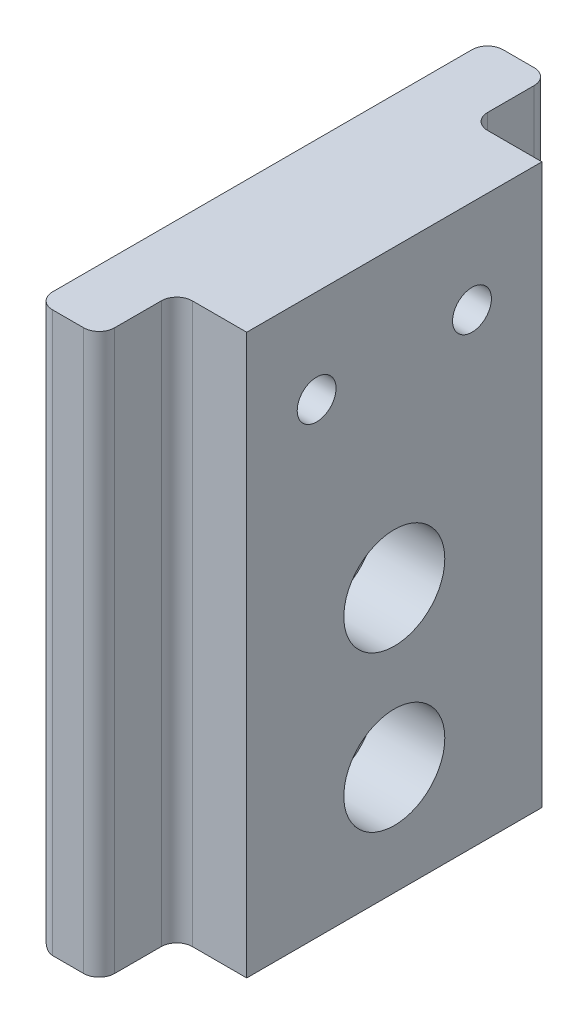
ISO-10303-21;
HEADER;
FILE_DESCRIPTION(('STEP AP214'),'2;1');
FILE_NAME('part.step','',(''),(''),'','','');
FILE_SCHEMA(('AUTOMOTIVE_DESIGN { 1 0 10303 214 1 1 1 1 }'));
ENDSEC;
DATA;
#1=APPLICATION_CONTEXT('core data for automotive mechanical design processes');
#2=APPLICATION_PROTOCOL_DEFINITION('international standard','automotive_design',2000,#1);
#3=PRODUCT_CONTEXT('',#1,'mechanical');
#4=PRODUCT('Part','Part','',(#3));
#5=PRODUCT_RELATED_PRODUCT_CATEGORY('part','',(#4));
#6=PRODUCT_DEFINITION_FORMATION('','',#4);
#7=PRODUCT_DEFINITION_CONTEXT('part definition',#1,'design');
#8=PRODUCT_DEFINITION('design','',#6,#7);
#9=PRODUCT_DEFINITION_SHAPE('','',#8);
#10=(LENGTH_UNIT() NAMED_UNIT(*) SI_UNIT(.MILLI.,.METRE.));
#11=(NAMED_UNIT(*) PLANE_ANGLE_UNIT() SI_UNIT($,.RADIAN.));
#12=(NAMED_UNIT(*) SI_UNIT($,.STERADIAN.) SOLID_ANGLE_UNIT());
#13=UNCERTAINTY_MEASURE_WITH_UNIT(LENGTH_MEASURE(1.E-05),#10,'distance_accuracy_value','');
#14=(GEOMETRIC_REPRESENTATION_CONTEXT(3) GLOBAL_UNCERTAINTY_ASSIGNED_CONTEXT((#13)) GLOBAL_UNIT_ASSIGNED_CONTEXT((#10,
#11,#12)) REPRESENTATION_CONTEXT('',''));
#15=CARTESIAN_POINT('',(0.,0.,0.));
#16=DIRECTION('',(0.,0.,1.));
#17=DIRECTION('',(1.,0.,0.));
#18=AXIS2_PLACEMENT_3D('',#15,#16,#17);
#19=CARTESIAN_POINT('',(0.,0.,0.));
#20=DIRECTION('',(1.,0.,0.));
#21=DIRECTION('',(0.,0.,-1.));
#22=AXIS2_PLACEMENT_3D('',#19,#20,#21);
#23=PLANE('',#22);
#24=DIRECTION('',(0.,0.,1.));
#25=VECTOR('',#24,1.);
#26=CARTESIAN_POINT('',(0.,6.,10.));
#27=LINE('',#26,#25);
#28=CARTESIAN_POINT('',(0.,6.,-9.5));
#29=VERTEX_POINT('',#28);
#30=CARTESIAN_POINT('',(0.,6.,9.5));
#31=VERTEX_POINT('',#30);
#32=EDGE_CURVE('E152',#29,#31,#27,.T.);
#33=ORIENTED_EDGE('',*,*,#32,.T.);
#34=DIRECTION('',(0.,1.,0.));
#35=VECTOR('',#34,1.);
#36=CARTESIAN_POINT('',(0.,-30.,9.5));
#37=LINE('',#36,#35);
#38=CARTESIAN_POINT('',(0.,-30.,9.5));
#39=VERTEX_POINT('',#38);
#40=EDGE_CURVE('E137',#39,#31,#37,.T.);
#41=ORIENTED_EDGE('',*,*,#40,.F.);
#42=DIRECTION('',(0.,0.,-1.));
#43=VECTOR('',#42,1.);
#44=CARTESIAN_POINT('',(0.,-30.,-10.));
#45=LINE('',#44,#43);
#46=CARTESIAN_POINT('',(0.,-30.,-9.5));
#47=VERTEX_POINT('',#46);
#48=EDGE_CURVE('E249',#39,#47,#45,.T.);
#49=ORIENTED_EDGE('',*,*,#48,.T.);
#50=DIRECTION('',(0.,1.,0.));
#51=VECTOR('',#50,1.);
#52=CARTESIAN_POINT('',(0.,-30.,-9.5));
#53=LINE('',#52,#51);
#54=EDGE_CURVE('E147',#47,#29,#53,.T.);
#55=ORIENTED_EDGE('',*,*,#54,.T.);
#56=EDGE_LOOP('',(#33,#41,#49,#55));
#57=FACE_BOUND('',#56,.T.);
#58=CARTESIAN_POINT('',(0.,0.,-5.));
#59=DIRECTION('',(1.,0.,0.));
#60=DIRECTION('',(0.,0.,-1.));
#61=AXIS2_PLACEMENT_3D('',#58,#59,#60);
#62=CIRCLE('',#61,1.25);
#63=CARTESIAN_POINT('',(0.,0.,-6.25));
#64=VERTEX_POINT('',#63);
#65=EDGE_CURVE('E164',#64,#64,#62,.F.);
#66=ORIENTED_EDGE('',*,*,#65,.T.);
#67=EDGE_LOOP('',(#66));
#68=FACE_BOUND('',#67,.T.);
#69=CARTESIAN_POINT('',(0.,0.,5.));
#70=DIRECTION('',(1.,0.,0.));
#71=DIRECTION('',(0.,0.,-1.));
#72=AXIS2_PLACEMENT_3D('',#69,#70,#71);
#73=CIRCLE('',#72,1.25);
#74=CARTESIAN_POINT('',(0.,0.,3.75));
#75=VERTEX_POINT('',#74);
#76=EDGE_CURVE('E160',#75,#75,#73,.F.);
#77=ORIENTED_EDGE('',*,*,#76,.T.);
#78=EDGE_LOOP('',(#77));
#79=FACE_BOUND('',#78,.T.);
#80=CARTESIAN_POINT('',(0.,-13.,0.));
#81=DIRECTION('',(1.,0.,0.));
#82=DIRECTION('',(0.,0.,-1.));
#83=AXIS2_PLACEMENT_3D('',#80,#81,#82);
#84=CIRCLE('',#83,3.25);
#85=CARTESIAN_POINT('',(0.,-13.,-3.25));
#86=VERTEX_POINT('',#85);
#87=EDGE_CURVE('E288',#86,#86,#84,.T.);
#88=ORIENTED_EDGE('',*,*,#87,.F.);
#89=EDGE_LOOP('',(#88));
#90=FACE_BOUND('',#89,.T.);
#91=CARTESIAN_POINT('',(0.,-23.,0.));
#92=DIRECTION('',(1.,0.,0.));
#93=DIRECTION('',(0.,0.,-1.));
#94=AXIS2_PLACEMENT_3D('',#91,#92,#93);
#95=CIRCLE('',#94,3.25);
#96=CARTESIAN_POINT('',(0.,-23.,-3.25));
#97=VERTEX_POINT('',#96);
#98=EDGE_CURVE('E296',#97,#97,#95,.T.);
#99=ORIENTED_EDGE('',*,*,#98,.F.);
#100=EDGE_LOOP('',(#99));
#101=FACE_BOUND('',#100,.T.);
#102=ADVANCED_FACE('F41',(#57,#68,#79,#90,#101),#23,.T.);
#103=CARTESIAN_POINT('',(-4.5,1.7,5.));
#104=DIRECTION('',(1.,0.,0.));
#105=DIRECTION('',(0.,0.,-1.));
#106=AXIS2_PLACEMENT_3D('',#103,#104,#105);
#107=PLANE('',#106);
#108=CARTESIAN_POINT('',(-4.5,0.,5.));
#109=DIRECTION('',(-1.,0.,0.));
#110=DIRECTION('',(0.,0.,1.));
#111=AXIS2_PLACEMENT_3D('',#108,#109,#110);
#112=CIRCLE('',#111,1.7);
#113=CARTESIAN_POINT('',(-4.5,0.,6.69999999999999));
#114=VERTEX_POINT('',#113);
#115=EDGE_CURVE('E310',#114,#114,#112,.T.);
#116=ORIENTED_EDGE('',*,*,#115,.F.);
#117=EDGE_LOOP('',(#116));
#118=FACE_BOUND('',#117,.T.);
#119=CARTESIAN_POINT('',(-4.5,0.,5.));
#120=DIRECTION('',(-1.,0.,0.));
#121=DIRECTION('',(0.,0.,1.));
#122=AXIS2_PLACEMENT_3D('',#119,#120,#121);
#123=CIRCLE('',#122,3.25);
#124=CARTESIAN_POINT('',(-4.5,0.,8.25));
#125=VERTEX_POINT('',#124);
#126=EDGE_CURVE('E313',#125,#125,#123,.T.);
#127=ORIENTED_EDGE('',*,*,#126,.T.);
#128=EDGE_LOOP('',(#127));
#129=FACE_BOUND('',#128,.T.);
#130=ADVANCED_FACE('F193',(#118,#129),#107,.F.);
#131=CARTESIAN_POINT('',(-9.,0.,5.));
#132=DIRECTION('',(-1.,0.,0.));
#133=DIRECTION('',(0.,0.,1.));
#134=AXIS2_PLACEMENT_3D('',#131,#132,#133);
#135=CYLINDRICAL_SURFACE('',#134,1.7);
#136=CARTESIAN_POINT('',(-4.,0.,5.));
#137=DIRECTION('',(-1.,0.,0.));
#138=DIRECTION('',(0.,0.,1.));
#139=AXIS2_PLACEMENT_3D('',#136,#137,#138);
#140=CIRCLE('',#139,1.7);
#141=CARTESIAN_POINT('',(-4.,0.,6.69999999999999));
#142=VERTEX_POINT('',#141);
#143=EDGE_CURVE('E287',#142,#142,#140,.T.);
#144=ORIENTED_EDGE('',*,*,#143,.F.);
#145=EDGE_LOOP('',(#144));
#146=FACE_BOUND('',#145,.T.);
#147=ORIENTED_EDGE('',*,*,#115,.T.);
#148=EDGE_LOOP('',(#147));
#149=FACE_BOUND('',#148,.T.);
#150=ADVANCED_FACE('F195',(#146,#149),#135,.F.);
#151=CARTESIAN_POINT('',(-4.,0.,5.));
#152=DIRECTION('',(-1.,0.,0.));
#153=DIRECTION('',(0.,0.,1.));
#154=AXIS2_PLACEMENT_3D('',#151,#152,#153);
#155=CONICAL_SURFACE('',#154,1.7,1.02974425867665);
#156=ORIENTED_EDGE('',*,*,#143,.T.);
#157=EDGE_LOOP('',(#156));
#158=FACE_BOUND('',#157,.T.);
#159=CARTESIAN_POINT('',(-3.7296127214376,0.,5.));
#160=DIRECTION('',(-1.,0.,0.));
#161=DIRECTION('',(0.,0.,1.));
#162=AXIS2_PLACEMENT_3D('',#159,#160,#161);
#163=CIRCLE('',#162,1.25);
#164=CARTESIAN_POINT('',(-3.7296127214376,0.,6.25));
#165=VERTEX_POINT('',#164);
#166=EDGE_CURVE('E284',#165,#165,#163,.T.);
#167=ORIENTED_EDGE('',*,*,#166,.F.);
#168=EDGE_LOOP('',(#167));
#169=FACE_BOUND('',#168,.T.);
#170=ADVANCED_FACE('F202',(#158,#169),#155,.F.);
#171=CARTESIAN_POINT('',(-9.,0.,5.));
#172=DIRECTION('',(-1.,0.,0.));
#173=DIRECTION('',(0.,0.,1.));
#174=AXIS2_PLACEMENT_3D('',#171,#172,#173);
#175=CYLINDRICAL_SURFACE('',#174,1.25);
#176=ORIENTED_EDGE('',*,*,#166,.T.);
#177=EDGE_LOOP('',(#176));
#178=FACE_BOUND('',#177,.T.);
#179=ORIENTED_EDGE('',*,*,#76,.F.);
#180=EDGE_LOOP('',(#179));
#181=FACE_BOUND('',#180,.T.);
#182=ADVANCED_FACE('F222',(#178,#181),#175,.F.);
#183=CARTESIAN_POINT('',(-4.5,1.7,-5.));
#184=DIRECTION('',(1.,0.,0.));
#185=DIRECTION('',(0.,0.,-1.));
#186=AXIS2_PLACEMENT_3D('',#183,#184,#185);
#187=PLANE('',#186);
#188=CARTESIAN_POINT('',(-4.5,0.,-5.));
#189=DIRECTION('',(-1.,0.,0.));
#190=DIRECTION('',(0.,0.,1.));
#191=AXIS2_PLACEMENT_3D('',#188,#189,#190);
#192=CIRCLE('',#191,1.7);
#193=CARTESIAN_POINT('',(-4.5,0.,-3.3));
#194=VERTEX_POINT('',#193);
#195=EDGE_CURVE('E243',#194,#194,#192,.T.);
#196=ORIENTED_EDGE('',*,*,#195,.F.);
#197=EDGE_LOOP('',(#196));
#198=FACE_BOUND('',#197,.T.);
#199=CARTESIAN_POINT('',(-4.5,0.,-5.));
#200=DIRECTION('',(-1.,0.,0.));
#201=DIRECTION('',(0.,0.,1.));
#202=AXIS2_PLACEMENT_3D('',#199,#200,#201);
#203=CIRCLE('',#202,3.25);
#204=CARTESIAN_POINT('',(-4.5,0.,-1.75));
#205=VERTEX_POINT('',#204);
#206=EDGE_CURVE('E167',#205,#205,#203,.T.);
#207=ORIENTED_EDGE('',*,*,#206,.T.);
#208=EDGE_LOOP('',(#207));
#209=FACE_BOUND('',#208,.T.);
#210=ADVANCED_FACE('F218',(#198,#209),#187,.F.);
#211=CARTESIAN_POINT('',(-9.,0.,-5.));
#212=DIRECTION('',(-1.,0.,0.));
#213=DIRECTION('',(0.,0.,1.));
#214=AXIS2_PLACEMENT_3D('',#211,#212,#213);
#215=CYLINDRICAL_SURFACE('',#214,1.7);
#216=CARTESIAN_POINT('',(-4.,0.,-5.));
#217=DIRECTION('',(-1.,0.,0.));
#218=DIRECTION('',(0.,0.,1.));
#219=AXIS2_PLACEMENT_3D('',#216,#217,#218);
#220=CIRCLE('',#219,1.7);
#221=CARTESIAN_POINT('',(-4.,0.,-3.3));
#222=VERTEX_POINT('',#221);
#223=EDGE_CURVE('E283',#222,#222,#220,.T.);
#224=ORIENTED_EDGE('',*,*,#223,.F.);
#225=EDGE_LOOP('',(#224));
#226=FACE_BOUND('',#225,.T.);
#227=ORIENTED_EDGE('',*,*,#195,.T.);
#228=EDGE_LOOP('',(#227));
#229=FACE_BOUND('',#228,.T.);
#230=ADVANCED_FACE('F187',(#226,#229),#215,.F.);
#231=CARTESIAN_POINT('',(-4.,0.,-5.));
#232=DIRECTION('',(-1.,0.,0.));
#233=DIRECTION('',(0.,0.,1.));
#234=AXIS2_PLACEMENT_3D('',#231,#232,#233);
#235=CONICAL_SURFACE('',#234,1.7,1.02974425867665);
#236=ORIENTED_EDGE('',*,*,#223,.T.);
#237=EDGE_LOOP('',(#236));
#238=FACE_BOUND('',#237,.T.);
#239=CARTESIAN_POINT('',(-3.7296127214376,0.,-5.));
#240=DIRECTION('',(-1.,0.,0.));
#241=DIRECTION('',(0.,0.,1.));
#242=AXIS2_PLACEMENT_3D('',#239,#240,#241);
#243=CIRCLE('',#242,1.25);
#244=CARTESIAN_POINT('',(-3.7296127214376,0.,-3.75));
#245=VERTEX_POINT('',#244);
#246=EDGE_CURVE('E281',#245,#245,#243,.T.);
#247=ORIENTED_EDGE('',*,*,#246,.F.);
#248=EDGE_LOOP('',(#247));
#249=FACE_BOUND('',#248,.T.);
#250=ADVANCED_FACE('F177',(#238,#249),#235,.F.);
#251=CARTESIAN_POINT('',(-9.,0.,-5.));
#252=DIRECTION('',(-1.,0.,0.));
#253=DIRECTION('',(0.,0.,1.));
#254=AXIS2_PLACEMENT_3D('',#251,#252,#253);
#255=CYLINDRICAL_SURFACE('',#254,1.25);
#256=ORIENTED_EDGE('',*,*,#246,.T.);
#257=EDGE_LOOP('',(#256));
#258=FACE_BOUND('',#257,.T.);
#259=ORIENTED_EDGE('',*,*,#65,.F.);
#260=EDGE_LOOP('',(#259));
#261=FACE_BOUND('',#260,.T.);
#262=ADVANCED_FACE('F174',(#258,#261),#255,.F.);
#263=CARTESIAN_POINT('',(0.,-23.,0.));
#264=DIRECTION('',(1.,0.,0.));
#265=DIRECTION('',(0.,0.,-1.));
#266=AXIS2_PLACEMENT_3D('',#263,#264,#265);
#267=CYLINDRICAL_SURFACE('',#266,1.7);
#268=CARTESIAN_POINT('',(-8.5,-23.,0.));
#269=DIRECTION('',(-1.,0.,0.));
#270=DIRECTION('',(0.,0.,1.));
#271=AXIS2_PLACEMENT_3D('',#268,#269,#270);
#272=CIRCLE('',#271,1.7);
#273=CARTESIAN_POINT('',(-8.5,-23.,1.7));
#274=VERTEX_POINT('',#273);
#275=EDGE_CURVE('E280',#274,#274,#272,.F.);
#276=ORIENTED_EDGE('',*,*,#275,.F.);
#277=EDGE_LOOP('',(#276));
#278=FACE_BOUND('',#277,.T.);
#279=CARTESIAN_POINT('',(-4.5,-23.,0.));
#280=DIRECTION('',(1.,0.,0.));
#281=DIRECTION('',(0.,0.,-1.));
#282=AXIS2_PLACEMENT_3D('',#279,#280,#281);
#283=CIRCLE('',#282,1.7);
#284=CARTESIAN_POINT('',(-4.5,-23.,-1.7));
#285=VERTEX_POINT('',#284);
#286=EDGE_CURVE('E290',#285,#285,#283,.T.);
#287=ORIENTED_EDGE('',*,*,#286,.T.);
#288=EDGE_LOOP('',(#287));
#289=FACE_BOUND('',#288,.T.);
#290=ADVANCED_FACE('F176',(#278,#289),#267,.F.);
#291=CARTESIAN_POINT('',(-4.5,-21.3,0.));
#292=DIRECTION('',(-1.,0.,0.));
#293=DIRECTION('',(0.,0.,1.));
#294=AXIS2_PLACEMENT_3D('',#291,#292,#293);
#295=PLANE('',#294);
#296=ORIENTED_EDGE('',*,*,#286,.F.);
#297=EDGE_LOOP('',(#296));
#298=FACE_BOUND('',#297,.T.);
#299=CARTESIAN_POINT('',(-4.5,-23.,0.));
#300=DIRECTION('',(1.,0.,0.));
#301=DIRECTION('',(0.,0.,-1.));
#302=AXIS2_PLACEMENT_3D('',#299,#300,#301);
#303=CIRCLE('',#302,3.25);
#304=CARTESIAN_POINT('',(-4.5,-23.,-3.25));
#305=VERTEX_POINT('',#304);
#306=EDGE_CURVE('E293',#305,#305,#303,.T.);
#307=ORIENTED_EDGE('',*,*,#306,.T.);
#308=EDGE_LOOP('',(#307));
#309=FACE_BOUND('',#308,.T.);
#310=ADVANCED_FACE('F184',(#298,#309),#295,.F.);
#311=CARTESIAN_POINT('',(0.,-23.,0.));
#312=DIRECTION('',(1.,0.,0.));
#313=DIRECTION('',(0.,0.,-1.));
#314=AXIS2_PLACEMENT_3D('',#311,#312,#313);
#315=CYLINDRICAL_SURFACE('',#314,3.25);
#316=ORIENTED_EDGE('',*,*,#306,.F.);
#317=EDGE_LOOP('',(#316));
#318=FACE_BOUND('',#317,.T.);
#319=ORIENTED_EDGE('',*,*,#98,.T.);
#320=EDGE_LOOP('',(#319));
#321=FACE_BOUND('',#320,.T.);
#322=ADVANCED_FACE('F454',(#318,#321),#315,.F.);
#323=CARTESIAN_POINT('',(0.,-13.,0.));
#324=DIRECTION('',(1.,0.,0.));
#325=DIRECTION('',(0.,0.,-1.));
#326=AXIS2_PLACEMENT_3D('',#323,#324,#325);
#327=CYLINDRICAL_SURFACE('',#326,1.7);
#328=CARTESIAN_POINT('',(-8.5,-13.,0.));
#329=DIRECTION('',(-1.,0.,0.));
#330=DIRECTION('',(0.,0.,1.));
#331=AXIS2_PLACEMENT_3D('',#328,#329,#330);
#332=CIRCLE('',#331,1.7);
#333=CARTESIAN_POINT('',(-8.5,-13.,1.7));
#334=VERTEX_POINT('',#333);
#335=EDGE_CURVE('E299',#334,#334,#332,.F.);
#336=ORIENTED_EDGE('',*,*,#335,.F.);
#337=EDGE_LOOP('',(#336));
#338=FACE_BOUND('',#337,.T.);
#339=CARTESIAN_POINT('',(-4.5,-13.,0.));
#340=DIRECTION('',(1.,0.,0.));
#341=DIRECTION('',(0.,0.,-1.));
#342=AXIS2_PLACEMENT_3D('',#339,#340,#341);
#343=CIRCLE('',#342,1.7);
#344=CARTESIAN_POINT('',(-4.5,-13.,-1.7));
#345=VERTEX_POINT('',#344);
#346=EDGE_CURVE('E300',#345,#345,#343,.T.);
#347=ORIENTED_EDGE('',*,*,#346,.T.);
#348=EDGE_LOOP('',(#347));
#349=FACE_BOUND('',#348,.T.);
#350=ADVANCED_FACE('F458',(#338,#349),#327,.F.);
#351=CARTESIAN_POINT('',(-4.5,-11.3,0.));
#352=DIRECTION('',(-1.,0.,0.));
#353=DIRECTION('',(0.,0.,1.));
#354=AXIS2_PLACEMENT_3D('',#351,#352,#353);
#355=PLANE('',#354);
#356=ORIENTED_EDGE('',*,*,#346,.F.);
#357=EDGE_LOOP('',(#356));
#358=FACE_BOUND('',#357,.T.);
#359=CARTESIAN_POINT('',(-4.5,-13.,0.));
#360=DIRECTION('',(1.,0.,0.));
#361=DIRECTION('',(0.,0.,-1.));
#362=AXIS2_PLACEMENT_3D('',#359,#360,#361);
#363=CIRCLE('',#362,3.25);
#364=CARTESIAN_POINT('',(-4.5,-13.,-3.25));
#365=VERTEX_POINT('',#364);
#366=EDGE_CURVE('E303',#365,#365,#363,.T.);
#367=ORIENTED_EDGE('',*,*,#366,.T.);
#368=EDGE_LOOP('',(#367));
#369=FACE_BOUND('',#368,.T.);
#370=ADVANCED_FACE('F462',(#358,#369),#355,.F.);
#371=CARTESIAN_POINT('',(0.,-13.,0.));
#372=DIRECTION('',(1.,0.,0.));
#373=DIRECTION('',(0.,0.,-1.));
#374=AXIS2_PLACEMENT_3D('',#371,#372,#373);
#375=CYLINDRICAL_SURFACE('',#374,3.25);
#376=ORIENTED_EDGE('',*,*,#366,.F.);
#377=EDGE_LOOP('',(#376));
#378=FACE_BOUND('',#377,.T.);
#379=ORIENTED_EDGE('',*,*,#87,.T.);
#380=EDGE_LOOP('',(#379));
#381=FACE_BOUND('',#380,.T.);
#382=ADVANCED_FACE('F213',(#378,#381),#375,.F.);
#383=CARTESIAN_POINT('',(-9.,0.,5.));
#384=DIRECTION('',(-1.,0.,0.));
#385=DIRECTION('',(0.,0.,1.));
#386=AXIS2_PLACEMENT_3D('',#383,#384,#385);
#387=CYLINDRICAL_SURFACE('',#386,3.25);
#388=ORIENTED_EDGE('',*,*,#126,.F.);
#389=EDGE_LOOP('',(#388));
#390=FACE_BOUND('',#389,.T.);
#391=CARTESIAN_POINT('',(-8.5,0.,5.));
#392=DIRECTION('',(-1.,0.,0.));
#393=DIRECTION('',(0.,0.,1.));
#394=AXIS2_PLACEMENT_3D('',#391,#392,#393);
#395=CIRCLE('',#394,3.25);
#396=CARTESIAN_POINT('',(-8.5,0.,8.25));
#397=VERTEX_POINT('',#396);
#398=EDGE_CURVE('E246',#397,#397,#395,.T.);
#399=ORIENTED_EDGE('',*,*,#398,.T.);
#400=EDGE_LOOP('',(#399));
#401=FACE_BOUND('',#400,.T.);
#402=ADVANCED_FACE('F210',(#390,#401),#387,.F.);
#403=CARTESIAN_POINT('',(-9.,0.,-5.));
#404=DIRECTION('',(-1.,0.,0.));
#405=DIRECTION('',(0.,0.,1.));
#406=AXIS2_PLACEMENT_3D('',#403,#404,#405);
#407=CYLINDRICAL_SURFACE('',#406,3.25);
#408=ORIENTED_EDGE('',*,*,#206,.F.);
#409=EDGE_LOOP('',(#408));
#410=FACE_BOUND('',#409,.T.);
#411=CARTESIAN_POINT('',(-8.5,0.,-5.));
#412=DIRECTION('',(-1.,0.,0.));
#413=DIRECTION('',(0.,0.,1.));
#414=AXIS2_PLACEMENT_3D('',#411,#412,#413);
#415=CIRCLE('',#414,3.25);
#416=CARTESIAN_POINT('',(-8.5,0.,-1.75));
#417=VERTEX_POINT('',#416);
#418=EDGE_CURVE('E238',#417,#417,#415,.T.);
#419=ORIENTED_EDGE('',*,*,#418,.T.);
#420=EDGE_LOOP('',(#419));
#421=FACE_BOUND('',#420,.T.);
#422=ADVANCED_FACE('F212',(#410,#421),#407,.F.);
#423=CARTESIAN_POINT('',(-7.5,-30.,13.5));
#424=DIRECTION('',(0.,1.,0.));
#425=DIRECTION('',(0.,0.,1.));
#426=AXIS2_PLACEMENT_3D('',#423,#424,#425);
#427=CYLINDRICAL_SURFACE('',#426,1.);
#428=CARTESIAN_POINT('',(-7.5,-29.,13.5));
#429=DIRECTION('',(0.,-0.707106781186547,-0.707106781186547));
#430=DIRECTION('',(0.,0.707106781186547,-0.707106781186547));
#431=AXIS2_PLACEMENT_3D('',#428,#429,#430);
#432=ELLIPSE('',#431,1.41421356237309,1.);
#433=CARTESIAN_POINT('',(-8.5,-29.,13.5));
#434=VERTEX_POINT('',#433);
#435=CARTESIAN_POINT('',(-7.5,-30.,14.5));
#436=VERTEX_POINT('',#435);
#437=EDGE_CURVE('E11',#434,#436,#432,.F.);
#438=ORIENTED_EDGE('',*,*,#437,.T.);
#439=DIRECTION('',(0.,1.,0.));
#440=VECTOR('',#439,1.);
#441=CARTESIAN_POINT('',(-7.5,-30.,14.5));
#442=LINE('',#441,#440);
#443=CARTESIAN_POINT('',(-7.5,6.,14.5));
#444=VERTEX_POINT('',#443);
#445=EDGE_CURVE('E359',#444,#436,#442,.F.);
#446=ORIENTED_EDGE('',*,*,#445,.F.);
#447=CARTESIAN_POINT('',(-7.5,6.,13.5));
#448=DIRECTION('',(0.,-1.,0.));
#449=DIRECTION('',(0.,0.,-1.));
#450=AXIS2_PLACEMENT_3D('',#447,#448,#449);
#451=CIRCLE('',#450,1.);
#452=CARTESIAN_POINT('',(-8.5,6.,13.5));
#453=VERTEX_POINT('',#452);
#454=EDGE_CURVE('E355',#453,#444,#451,.F.);
#455=ORIENTED_EDGE('',*,*,#454,.F.);
#456=DIRECTION('',(0.,1.,0.));
#457=VECTOR('',#456,1.);
#458=CARTESIAN_POINT('',(-8.5,-30.,13.5));
#459=LINE('',#458,#457);
#460=EDGE_CURVE('E344',#434,#453,#459,.T.);
#461=ORIENTED_EDGE('',*,*,#460,.F.);
#462=EDGE_LOOP('',(#438,#446,#455,#461));
#463=FACE_BOUND('',#462,.T.);
#464=ADVANCED_FACE('F225',(#463),#427,.T.);
#465=CARTESIAN_POINT('',(-8.5,-30.,-15.));
#466=DIRECTION('',(-1.,0.,0.));
#467=DIRECTION('',(0.,0.,1.));
#468=AXIS2_PLACEMENT_3D('',#465,#466,#467);
#469=PLANE('',#468);
#470=ORIENTED_EDGE('',*,*,#418,.F.);
#471=EDGE_LOOP('',(#470));
#472=FACE_BOUND('',#471,.T.);
#473=ORIENTED_EDGE('',*,*,#398,.F.);
#474=EDGE_LOOP('',(#473));
#475=FACE_BOUND('',#474,.T.);
#476=ORIENTED_EDGE('',*,*,#335,.T.);
#477=EDGE_LOOP('',(#476));
#478=FACE_BOUND('',#477,.T.);
#479=ORIENTED_EDGE('',*,*,#275,.T.);
#480=EDGE_LOOP('',(#479));
#481=FACE_BOUND('',#480,.T.);
#482=DIRECTION('',(0.,0.,1.));
#483=VECTOR('',#482,1.);
#484=CARTESIAN_POINT('',(-8.5,-29.,14.5));
#485=LINE('',#484,#483);
#486=CARTESIAN_POINT('',(-8.5,-29.,-13.5));
#487=VERTEX_POINT('',#486);
#488=EDGE_CURVE('E341',#487,#434,#485,.T.);
#489=ORIENTED_EDGE('',*,*,#488,.T.);
#490=ORIENTED_EDGE('',*,*,#460,.T.);
#491=DIRECTION('',(0.,0.,-1.));
#492=VECTOR('',#491,1.);
#493=CARTESIAN_POINT('',(-8.5,6.,10.));
#494=LINE('',#493,#492);
#495=CARTESIAN_POINT('',(-8.5,6.,-13.5));
#496=VERTEX_POINT('',#495);
#497=EDGE_CURVE('E270',#453,#496,#494,.T.);
#498=ORIENTED_EDGE('',*,*,#497,.T.);
#499=DIRECTION('',(0.,1.,0.));
#500=VECTOR('',#499,1.);
#501=CARTESIAN_POINT('',(-8.5,-30.,-13.5));
#502=LINE('',#501,#500);
#503=EDGE_CURVE('E347',#496,#487,#502,.F.);
#504=ORIENTED_EDGE('',*,*,#503,.T.);
#505=EDGE_LOOP('',(#489,#490,#498,#504));
#506=FACE_BOUND('',#505,.T.);
#507=ADVANCED_FACE('F230',(#472,#475,#478,#481,#506),#469,.T.);
#508=CARTESIAN_POINT('',(-7.5,-30.,-13.5));
#509=DIRECTION('',(0.,1.,0.));
#510=DIRECTION('',(0.,0.,1.));
#511=AXIS2_PLACEMENT_3D('',#508,#509,#510);
#512=CYLINDRICAL_SURFACE('',#511,1.);
#513=CARTESIAN_POINT('',(-7.5,6.,-13.5));
#514=DIRECTION('',(0.,-1.,0.));
#515=DIRECTION('',(0.,0.,-1.));
#516=AXIS2_PLACEMENT_3D('',#513,#514,#515);
#517=CIRCLE('',#516,1.);
#518=CARTESIAN_POINT('',(-7.5,6.,-14.5));
#519=VERTEX_POINT('',#518);
#520=EDGE_CURVE('E367',#519,#496,#517,.F.);
#521=ORIENTED_EDGE('',*,*,#520,.F.);
#522=DIRECTION('',(0.,1.,0.));
#523=VECTOR('',#522,1.);
#524=CARTESIAN_POINT('',(-7.5,-30.,-14.5));
#525=LINE('',#524,#523);
#526=CARTESIAN_POINT('',(-7.5,-30.,-14.5));
#527=VERTEX_POINT('',#526);
#528=EDGE_CURVE('E398',#527,#519,#525,.T.);
#529=ORIENTED_EDGE('',*,*,#528,.F.);
#530=CARTESIAN_POINT('',(-7.5,-29.,-13.5));
#531=DIRECTION('',(0.,0.707106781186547,-0.707106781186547));
#532=DIRECTION('',(0.,0.707106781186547,0.707106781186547));
#533=AXIS2_PLACEMENT_3D('',#530,#531,#532);
#534=ELLIPSE('',#533,1.41421356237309,1.);
#535=EDGE_CURVE('E51',#487,#527,#534,.F.);
#536=ORIENTED_EDGE('',*,*,#535,.F.);
#537=ORIENTED_EDGE('',*,*,#503,.F.);
#538=EDGE_LOOP('',(#521,#529,#536,#537));
#539=FACE_BOUND('',#538,.T.);
#540=ADVANCED_FACE('F331',(#539),#512,.T.);
#541=CARTESIAN_POINT('',(0.,6.,10.));
#542=DIRECTION('',(0.,-1.,0.));
#543=DIRECTION('',(0.,0.,-1.));
#544=AXIS2_PLACEMENT_3D('',#541,#542,#543);
#545=PLANE('',#544);
#546=ORIENTED_EDGE('',*,*,#32,.F.);
#547=DIRECTION('',(-1.,0.,0.));
#548=VECTOR('',#547,1.);
#549=CARTESIAN_POINT('',(0.,6.,-9.5));
#550=LINE('',#549,#548);
#551=CARTESIAN_POINT('',(-3.5,6.,-9.5));
#552=VERTEX_POINT('',#551);
#553=EDGE_CURVE('E45',#29,#552,#550,.T.);
#554=ORIENTED_EDGE('',*,*,#553,.T.);
#555=CARTESIAN_POINT('',(-3.5,6.,-10.5));
#556=DIRECTION('',(0.,-1.,0.));
#557=DIRECTION('',(0.,0.,-1.));
#558=AXIS2_PLACEMENT_3D('',#555,#556,#557);
#559=CIRCLE('',#558,1.);
#560=CARTESIAN_POINT('',(-4.5,6.,-10.5));
#561=VERTEX_POINT('',#560);
#562=EDGE_CURVE('E384',#552,#561,#559,.T.);
#563=ORIENTED_EDGE('',*,*,#562,.T.);
#564=DIRECTION('',(0.,0.,1.));
#565=VECTOR('',#564,1.);
#566=CARTESIAN_POINT('',(-4.5,6.,10.));
#567=LINE('',#566,#565);
#568=CARTESIAN_POINT('',(-4.5,6.,-13.5));
#569=VERTEX_POINT('',#568);
#570=EDGE_CURVE('E257',#569,#561,#567,.T.);
#571=ORIENTED_EDGE('',*,*,#570,.F.);
#572=CARTESIAN_POINT('',(-5.5,6.,-13.5));
#573=DIRECTION('',(0.,-1.,0.));
#574=DIRECTION('',(0.,0.,-1.));
#575=AXIS2_PLACEMENT_3D('',#572,#573,#574);
#576=CIRCLE('',#575,1.);
#577=CARTESIAN_POINT('',(-5.5,6.,-14.5));
#578=VERTEX_POINT('',#577);
#579=EDGE_CURVE('E365',#569,#578,#576,.F.);
#580=ORIENTED_EDGE('',*,*,#579,.T.);
#581=DIRECTION('',(1.,0.,0.));
#582=VECTOR('',#581,1.);
#583=CARTESIAN_POINT('',(0.,6.,-14.5));
#584=LINE('',#583,#582);
#585=EDGE_CURVE('E273',#519,#578,#584,.T.);
#586=ORIENTED_EDGE('',*,*,#585,.F.);
#587=ORIENTED_EDGE('',*,*,#520,.T.);
#588=ORIENTED_EDGE('',*,*,#497,.F.);
#589=ORIENTED_EDGE('',*,*,#454,.T.);
#590=DIRECTION('',(-1.,0.,0.));
#591=VECTOR('',#590,1.);
#592=CARTESIAN_POINT('',(0.,6.,14.5));
#593=LINE('',#592,#591);
#594=CARTESIAN_POINT('',(-5.5,6.,14.5));
#595=VERTEX_POINT('',#594);
#596=EDGE_CURVE('E266',#595,#444,#593,.T.);
#597=ORIENTED_EDGE('',*,*,#596,.F.);
#598=CARTESIAN_POINT('',(-5.5,6.,13.5));
#599=DIRECTION('',(0.,-1.,0.));
#600=DIRECTION('',(0.,0.,-1.));
#601=AXIS2_PLACEMENT_3D('',#598,#599,#600);
#602=CIRCLE('',#601,1.);
#603=CARTESIAN_POINT('',(-4.5,6.,13.5));
#604=VERTEX_POINT('',#603);
#605=EDGE_CURVE('E369',#595,#604,#602,.F.);
#606=ORIENTED_EDGE('',*,*,#605,.T.);
#607=DIRECTION('',(0.,0.,1.));
#608=VECTOR('',#607,1.);
#609=CARTESIAN_POINT('',(-4.5,6.,10.));
#610=LINE('',#609,#608);
#611=CARTESIAN_POINT('',(-4.5,6.,10.5));
#612=VERTEX_POINT('',#611);
#613=EDGE_CURVE('E269',#612,#604,#610,.T.);
#614=ORIENTED_EDGE('',*,*,#613,.F.);
#615=CARTESIAN_POINT('',(-3.5,6.,10.5));
#616=DIRECTION('',(0.,-1.,0.));
#617=DIRECTION('',(0.,0.,-1.));
#618=AXIS2_PLACEMENT_3D('',#615,#616,#617);
#619=CIRCLE('',#618,1.);
#620=CARTESIAN_POINT('',(-3.5,6.,9.5));
#621=VERTEX_POINT('',#620);
#622=EDGE_CURVE('E155',#612,#621,#619,.T.);
#623=ORIENTED_EDGE('',*,*,#622,.T.);
#624=DIRECTION('',(-1.,0.,0.));
#625=VECTOR('',#624,1.);
#626=CARTESIAN_POINT('',(0.,6.,9.5));
#627=LINE('',#626,#625);
#628=EDGE_CURVE('E140',#31,#621,#627,.T.);
#629=ORIENTED_EDGE('',*,*,#628,.F.);
#630=EDGE_LOOP('',(#546,#554,#563,#571,#580,#586,#587,#588,#589,#597,#606,#614,#623,#629));
#631=FACE_BOUND('',#630,.T.);
#632=ADVANCED_FACE('F151',(#631),#545,.F.);
#633=CARTESIAN_POINT('',(-5.5,-30.,13.5));
#634=DIRECTION('',(0.,1.,0.));
#635=DIRECTION('',(0.,0.,1.));
#636=AXIS2_PLACEMENT_3D('',#633,#634,#635);
#637=CYLINDRICAL_SURFACE('',#636,1.);
#638=CARTESIAN_POINT('',(-5.5,-30.,13.5));
#639=DIRECTION('',(0.,1.,0.));
#640=DIRECTION('',(0.,0.,1.));
#641=AXIS2_PLACEMENT_3D('',#638,#639,#640);
#642=CIRCLE('',#641,1.);
#643=CARTESIAN_POINT('',(-4.5,-30.,13.5));
#644=VERTEX_POINT('',#643);
#645=CARTESIAN_POINT('',(-5.5,-30.,14.5));
#646=VERTEX_POINT('',#645);
#647=EDGE_CURVE('E407',#644,#646,#642,.F.);
#648=ORIENTED_EDGE('',*,*,#647,.F.);
#649=DIRECTION('',(0.,1.,0.));
#650=VECTOR('',#649,1.);
#651=CARTESIAN_POINT('',(-4.5,-30.,13.5));
#652=LINE('',#651,#650);
#653=EDGE_CURVE('E387',#604,#644,#652,.F.);
#654=ORIENTED_EDGE('',*,*,#653,.F.);
#655=ORIENTED_EDGE('',*,*,#605,.F.);
#656=DIRECTION('',(0.,1.,0.));
#657=VECTOR('',#656,1.);
#658=CARTESIAN_POINT('',(-5.5,-30.,14.5));
#659=LINE('',#658,#657);
#660=EDGE_CURVE('E356',#646,#595,#659,.T.);
#661=ORIENTED_EDGE('',*,*,#660,.F.);
#662=EDGE_LOOP('',(#648,#654,#655,#661));
#663=FACE_BOUND('',#662,.T.);
#664=ADVANCED_FACE('F419',(#663),#637,.T.);
#665=CARTESIAN_POINT('',(-4.5,-30.,15.));
#666=DIRECTION('',(1.,0.,0.));
#667=DIRECTION('',(0.,0.,-1.));
#668=AXIS2_PLACEMENT_3D('',#665,#666,#667);
#669=PLANE('',#668);
#670=ORIENTED_EDGE('',*,*,#613,.T.);
#671=ORIENTED_EDGE('',*,*,#653,.T.);
#672=DIRECTION('',(0.,0.,-1.));
#673=VECTOR('',#672,1.);
#674=CARTESIAN_POINT('',(-4.5,-30.,0.));
#675=LINE('',#674,#673);
#676=CARTESIAN_POINT('',(-4.5,-30.,10.5));
#677=VERTEX_POINT('',#676);
#678=EDGE_CURVE('E248',#644,#677,#675,.T.);
#679=ORIENTED_EDGE('',*,*,#678,.T.);
#680=DIRECTION('',(0.,1.,0.));
#681=VECTOR('',#680,1.);
#682=CARTESIAN_POINT('',(-4.5,-30.,10.5));
#683=LINE('',#682,#681);
#684=EDGE_CURVE('E389',#677,#612,#683,.T.);
#685=ORIENTED_EDGE('',*,*,#684,.T.);
#686=EDGE_LOOP('',(#670,#671,#679,#685));
#687=FACE_BOUND('',#686,.T.);
#688=ADVANCED_FACE('F439',(#687),#669,.T.);
#689=CARTESIAN_POINT('',(-3.5,-30.,10.5));
#690=DIRECTION('',(0.,1.,0.));
#691=DIRECTION('',(0.,0.,1.));
#692=AXIS2_PLACEMENT_3D('',#689,#690,#691);
#693=CYLINDRICAL_SURFACE('',#692,1.);
#694=CARTESIAN_POINT('',(-3.5,-30.,10.5));
#695=DIRECTION('',(0.,1.,0.));
#696=DIRECTION('',(0.,0.,1.));
#697=AXIS2_PLACEMENT_3D('',#694,#695,#696);
#698=CIRCLE('',#697,1.);
#699=CARTESIAN_POINT('',(-3.5,-30.,9.5));
#700=VERTEX_POINT('',#699);
#701=EDGE_CURVE('E159',#700,#677,#698,.T.);
#702=ORIENTED_EDGE('',*,*,#701,.F.);
#703=DIRECTION('',(0.,1.,0.));
#704=VECTOR('',#703,1.);
#705=CARTESIAN_POINT('',(-3.5,0.,9.5));
#706=LINE('',#705,#704);
#707=EDGE_CURVE('E371',#621,#700,#706,.F.);
#708=ORIENTED_EDGE('',*,*,#707,.F.);
#709=ORIENTED_EDGE('',*,*,#622,.F.);
#710=ORIENTED_EDGE('',*,*,#684,.F.);
#711=EDGE_LOOP('',(#702,#708,#709,#710));
#712=FACE_BOUND('',#711,.T.);
#713=ADVANCED_FACE('F437',(#712),#693,.F.);
#714=CARTESIAN_POINT('',(0.,0.,9.5));
#715=DIRECTION('',(0.,0.,-1.));
#716=DIRECTION('',(-1.,0.,0.));
#717=AXIS2_PLACEMENT_3D('',#714,#715,#716);
#718=PLANE('',#717);
#719=ORIENTED_EDGE('',*,*,#40,.T.);
#720=ORIENTED_EDGE('',*,*,#628,.T.);
#721=ORIENTED_EDGE('',*,*,#707,.T.);
#722=DIRECTION('',(1.,0.,0.));
#723=VECTOR('',#722,1.);
#724=CARTESIAN_POINT('',(0.,-30.,9.5));
#725=LINE('',#724,#723);
#726=EDGE_CURVE('E58',#700,#39,#725,.T.);
#727=ORIENTED_EDGE('',*,*,#726,.T.);
#728=EDGE_LOOP('',(#719,#720,#721,#727));
#729=FACE_BOUND('',#728,.T.);
#730=ADVANCED_FACE('F139',(#729),#718,.F.);
#731=CARTESIAN_POINT('',(0.,0.,-9.5));
#732=DIRECTION('',(0.,0.,-1.));
#733=DIRECTION('',(-1.,0.,0.));
#734=AXIS2_PLACEMENT_3D('',#731,#732,#733);
#735=PLANE('',#734);
#736=ORIENTED_EDGE('',*,*,#553,.F.);
#737=ORIENTED_EDGE('',*,*,#54,.F.);
#738=DIRECTION('',(-1.,0.,0.));
#739=VECTOR('',#738,1.);
#740=CARTESIAN_POINT('',(0.,-30.,-9.5));
#741=LINE('',#740,#739);
#742=CARTESIAN_POINT('',(-3.5,-30.,-9.5));
#743=VERTEX_POINT('',#742);
#744=EDGE_CURVE('E146',#47,#743,#741,.T.);
#745=ORIENTED_EDGE('',*,*,#744,.T.);
#746=DIRECTION('',(0.,1.,0.));
#747=VECTOR('',#746,1.);
#748=CARTESIAN_POINT('',(-3.5,6.,-9.5));
#749=LINE('',#748,#747);
#750=EDGE_CURVE('E157',#743,#552,#749,.T.);
#751=ORIENTED_EDGE('',*,*,#750,.T.);
#752=EDGE_LOOP('',(#736,#737,#745,#751));
#753=FACE_BOUND('',#752,.T.);
#754=ADVANCED_FACE('F43',(#753),#735,.T.);
#755=CARTESIAN_POINT('',(-3.5,0.,-10.5));
#756=DIRECTION('',(0.,-1.,0.));
#757=DIRECTION('',(0.,0.,-1.));
#758=AXIS2_PLACEMENT_3D('',#755,#756,#757);
#759=CYLINDRICAL_SURFACE('',#758,1.);
#760=CARTESIAN_POINT('',(-3.5,-30.,-10.5));
#761=DIRECTION('',(0.,1.,0.));
#762=DIRECTION('',(0.,0.,1.));
#763=AXIS2_PLACEMENT_3D('',#760,#761,#762);
#764=CIRCLE('',#763,1.);
#765=CARTESIAN_POINT('',(-4.5,-30.,-10.5));
#766=VERTEX_POINT('',#765);
#767=EDGE_CURVE('E383',#766,#743,#764,.T.);
#768=ORIENTED_EDGE('',*,*,#767,.F.);
#769=DIRECTION('',(0.,1.,0.));
#770=VECTOR('',#769,1.);
#771=CARTESIAN_POINT('',(-4.5,-30.,-10.5));
#772=LINE('',#771,#770);
#773=EDGE_CURVE('E385',#561,#766,#772,.F.);
#774=ORIENTED_EDGE('',*,*,#773,.F.);
#775=ORIENTED_EDGE('',*,*,#562,.F.);
#776=ORIENTED_EDGE('',*,*,#750,.F.);
#777=EDGE_LOOP('',(#768,#774,#775,#776));
#778=FACE_BOUND('',#777,.T.);
#779=ADVANCED_FACE('F381',(#778),#759,.F.);
#780=CARTESIAN_POINT('',(-4.5,-30.,-10.));
#781=DIRECTION('',(1.,0.,0.));
#782=DIRECTION('',(0.,0.,-1.));
#783=AXIS2_PLACEMENT_3D('',#780,#781,#782);
#784=PLANE('',#783);
#785=ORIENTED_EDGE('',*,*,#570,.T.);
#786=ORIENTED_EDGE('',*,*,#773,.T.);
#787=DIRECTION('',(0.,0.,-1.));
#788=VECTOR('',#787,1.);
#789=CARTESIAN_POINT('',(-4.5,-30.,0.));
#790=LINE('',#789,#788);
#791=CARTESIAN_POINT('',(-4.5,-30.,-13.5));
#792=VERTEX_POINT('',#791);
#793=EDGE_CURVE('E254',#766,#792,#790,.T.);
#794=ORIENTED_EDGE('',*,*,#793,.T.);
#795=DIRECTION('',(0.,1.,0.));
#796=VECTOR('',#795,1.);
#797=CARTESIAN_POINT('',(-4.5,-30.,-13.5));
#798=LINE('',#797,#796);
#799=EDGE_CURVE('E401',#792,#569,#798,.T.);
#800=ORIENTED_EDGE('',*,*,#799,.T.);
#801=EDGE_LOOP('',(#785,#786,#794,#800));
#802=FACE_BOUND('',#801,.T.);
#803=ADVANCED_FACE('F432',(#802),#784,.T.);
#804=CARTESIAN_POINT('',(-5.5,-30.,-13.5));
#805=DIRECTION('',(0.,1.,0.));
#806=DIRECTION('',(0.,0.,1.));
#807=AXIS2_PLACEMENT_3D('',#804,#805,#806);
#808=CYLINDRICAL_SURFACE('',#807,1.);
#809=CARTESIAN_POINT('',(-5.5,-30.,-13.5));
#810=DIRECTION('',(0.,1.,0.));
#811=DIRECTION('',(0.,0.,1.));
#812=AXIS2_PLACEMENT_3D('',#809,#810,#811);
#813=CIRCLE('',#812,1.);
#814=CARTESIAN_POINT('',(-5.5,-30.,-14.5));
#815=VERTEX_POINT('',#814);
#816=EDGE_CURVE('E405',#815,#792,#813,.F.);
#817=ORIENTED_EDGE('',*,*,#816,.F.);
#818=DIRECTION('',(0.,1.,0.));
#819=VECTOR('',#818,1.);
#820=CARTESIAN_POINT('',(-5.5,-30.,-14.5));
#821=LINE('',#820,#819);
#822=EDGE_CURVE('E396',#578,#815,#821,.F.);
#823=ORIENTED_EDGE('',*,*,#822,.F.);
#824=ORIENTED_EDGE('',*,*,#579,.F.);
#825=ORIENTED_EDGE('',*,*,#799,.F.);
#826=EDGE_LOOP('',(#817,#823,#824,#825));
#827=FACE_BOUND('',#826,.T.);
#828=ADVANCED_FACE('F430',(#827),#808,.T.);
#829=CARTESIAN_POINT('',(-4.,-30.,-14.5));
#830=DIRECTION('',(0.,0.,-1.));
#831=DIRECTION('',(-1.,0.,0.));
#832=AXIS2_PLACEMENT_3D('',#829,#830,#831);
#833=PLANE('',#832);
#834=ORIENTED_EDGE('',*,*,#585,.T.);
#835=ORIENTED_EDGE('',*,*,#822,.T.);
#836=DIRECTION('',(-1.,0.,0.));
#837=VECTOR('',#836,1.);
#838=CARTESIAN_POINT('',(0.,-30.,-14.5));
#839=LINE('',#838,#837);
#840=EDGE_CURVE('E258',#815,#527,#839,.T.);
#841=ORIENTED_EDGE('',*,*,#840,.T.);
#842=ORIENTED_EDGE('',*,*,#528,.T.);
#843=EDGE_LOOP('',(#834,#835,#841,#842));
#844=FACE_BOUND('',#843,.T.);
#845=ADVANCED_FACE('F425',(#844),#833,.T.);
#846=CARTESIAN_POINT('',(-7.5,-29.,-15.));
#847=DIRECTION('',(0.,0.,-1.));
#848=DIRECTION('',(-1.,0.,0.));
#849=AXIS2_PLACEMENT_3D('',#846,#847,#848);
#850=CYLINDRICAL_SURFACE('',#849,1.);
#851=ORIENTED_EDGE('',*,*,#535,.T.);
#852=DIRECTION('',(0.,0.,1.));
#853=VECTOR('',#852,1.);
#854=CARTESIAN_POINT('',(-7.5,-30.,-14.5));
#855=LINE('',#854,#853);
#856=EDGE_CURVE('E353',#436,#527,#855,.F.);
#857=ORIENTED_EDGE('',*,*,#856,.F.);
#858=ORIENTED_EDGE('',*,*,#437,.F.);
#859=ORIENTED_EDGE('',*,*,#488,.F.);
#860=EDGE_LOOP('',(#851,#857,#858,#859));
#861=FACE_BOUND('',#860,.T.);
#862=ADVANCED_FACE('F352',(#861),#850,.T.);
#863=CARTESIAN_POINT('',(-9.,-30.,14.5));
#864=DIRECTION('',(0.,0.,1.));
#865=DIRECTION('',(1.,0.,0.));
#866=AXIS2_PLACEMENT_3D('',#863,#864,#865);
#867=PLANE('',#866);
#868=ORIENTED_EDGE('',*,*,#596,.T.);
#869=ORIENTED_EDGE('',*,*,#445,.T.);
#870=DIRECTION('',(1.,0.,0.));
#871=VECTOR('',#870,1.);
#872=CARTESIAN_POINT('',(0.,-30.,14.5));
#873=LINE('',#872,#871);
#874=EDGE_CURVE('E261',#436,#646,#873,.T.);
#875=ORIENTED_EDGE('',*,*,#874,.T.);
#876=ORIENTED_EDGE('',*,*,#660,.T.);
#877=EDGE_LOOP('',(#868,#869,#875,#876));
#878=FACE_BOUND('',#877,.T.);
#879=ADVANCED_FACE('F410',(#878),#867,.T.);
#880=CARTESIAN_POINT('',(0.,-30.,0.));
#881=DIRECTION('',(0.,1.,0.));
#882=DIRECTION('',(0.,0.,1.));
#883=AXIS2_PLACEMENT_3D('',#880,#881,#882);
#884=PLANE('',#883);
#885=ORIENTED_EDGE('',*,*,#874,.F.);
#886=ORIENTED_EDGE('',*,*,#856,.T.);
#887=ORIENTED_EDGE('',*,*,#840,.F.);
#888=ORIENTED_EDGE('',*,*,#816,.T.);
#889=ORIENTED_EDGE('',*,*,#793,.F.);
#890=ORIENTED_EDGE('',*,*,#767,.T.);
#891=ORIENTED_EDGE('',*,*,#744,.F.);
#892=ORIENTED_EDGE('',*,*,#48,.F.);
#893=ORIENTED_EDGE('',*,*,#726,.F.);
#894=ORIENTED_EDGE('',*,*,#701,.T.);
#895=ORIENTED_EDGE('',*,*,#678,.F.);
#896=ORIENTED_EDGE('',*,*,#647,.T.);
#897=EDGE_LOOP('',(#885,#886,#887,#888,#889,#890,#891,#892,#893,#894,#895,#896));
#898=FACE_BOUND('',#897,.T.);
#899=ADVANCED_FACE('F205',(#898),#884,.F.);
#900=CLOSED_SHELL('',(#102,#130,#150,#170,#182,#210,#230,#250,#262,#290,#310,#322,#350,#370,
#382,#402,#422,#464,#507,#540,#632,#664,#688,#713,#730,#754,#779,#803,#828,#845,#862,#879,#899));
#901=MANIFOLD_SOLID_BREP('B2',#900);
#902=ADVANCED_BREP_SHAPE_REPRESENTATION('',(#18,#901),#14);
#903=SHAPE_DEFINITION_REPRESENTATION(#9,#902);
ENDSEC;
END-ISO-10303-21;
